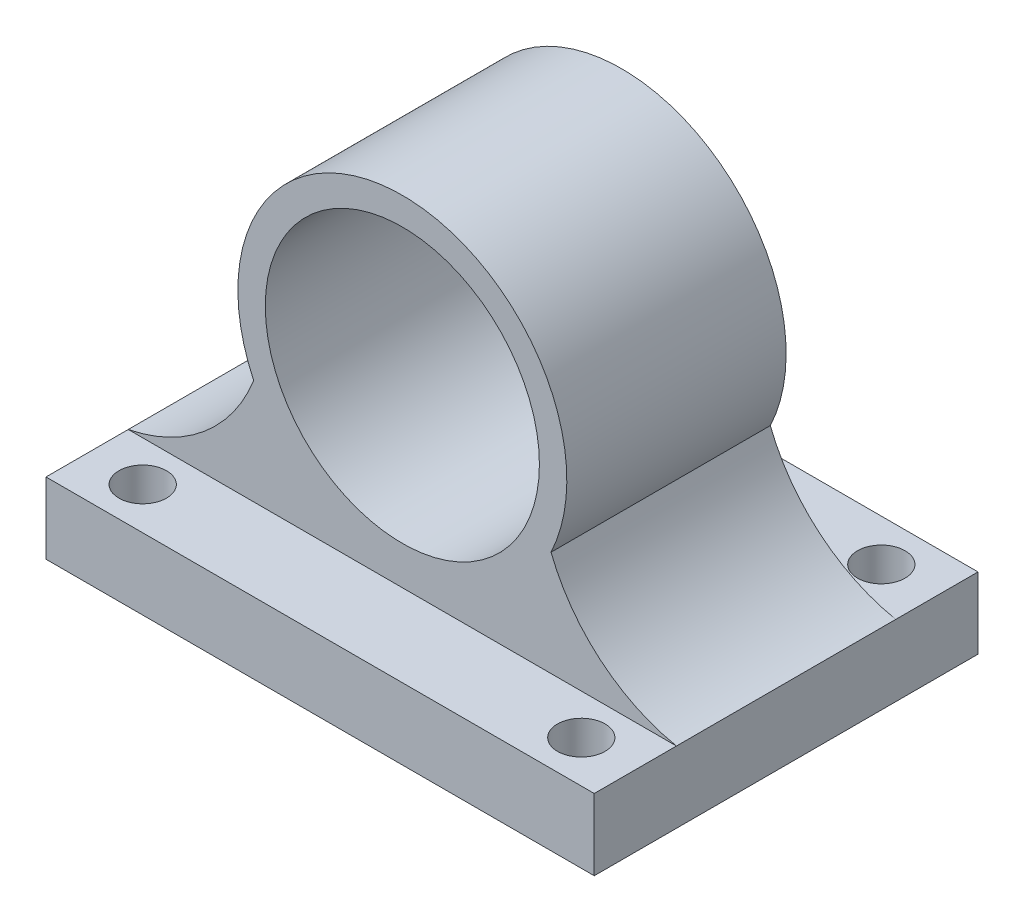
from build123d import *

# Parameters (mm, degrees)
SKETCH1_W      = 63.5
SKETCH1_H      = 44.45
EXTRUDE1_DEPTH = 8.255
SKETCH4_R      = 15.875
EXTRUDE2_DEPTH = 25.4
SKETCH5_R      = 2.7559
EXTRUDE3_DEPTH = 25.4


with BuildPart() as part:
    # Sketch1 → Extrude1 (new body)
    with BuildSketch(Plane(origin=(0, 0, 0), x_dir=(1, 0, 0), z_dir=(0, 1, 0))):
        Rectangle(SKETCH1_W, SKETCH1_H)
    extrude(amount=EXTRUDE1_DEPTH)

    # Sketch4 → Extrude2 (add)
    with BuildSketch(Plane.XY.offset(12.7)):
        with BuildLine():
            Line((-31.75, 8.255), (31.75, 8.255))
            ThreePointArc((31.75, 8.255), (22.928016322, 12.483481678), (17.220501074, 20.429029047))
            ThreePointArc((17.220501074, 20.429029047), (0, 47.625), (-17.220501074, 20.429029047))
            ThreePointArc((-17.220501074, 20.429029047), (-22.928016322, 12.483481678), (-31.75, 8.255))
        make_face()
        with Locations((0, 28.575)):
            Circle(SKETCH4_R, mode=Mode.SUBTRACT)
    extrude(amount=-EXTRUDE2_DEPTH)

    # Sketch5 → Extrude3 (cut)
    with BuildSketch(Plane.XZ):
        with Locations(Location((-25.4, -17.3736, 0), (0, 0, 270))):
            Circle(SKETCH5_R)
        with Locations(Location((25.4, -17.3736, 0), (0, 0, 270))):
            Circle(SKETCH5_R)
        with Locations(Location((25.4, 17.3736, 0), (0, 0, 270))):
            Circle(SKETCH5_R)
        with Locations(Location((-25.4, 17.3736, 0), (0, 0, 270))):
            Circle(SKETCH5_R)
    extrude(amount=-EXTRUDE3_DEPTH, mode=Mode.SUBTRACT)


solid = part.part
